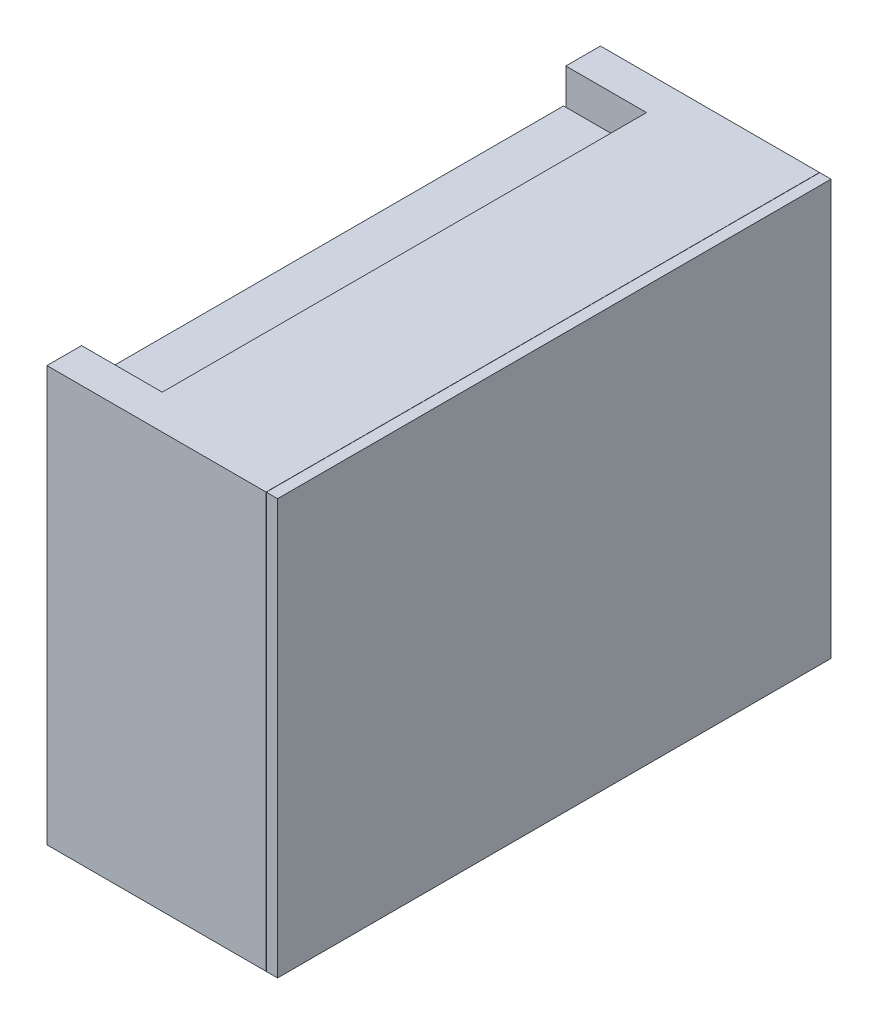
ISO-10303-21;
HEADER;
FILE_DESCRIPTION(('STEP AP214'),'2;1');
FILE_NAME('part.step','',(''),(''),'','','');
FILE_SCHEMA(('AUTOMOTIVE_DESIGN { 1 0 10303 214 1 1 1 1 }'));
ENDSEC;
DATA;
#1=APPLICATION_CONTEXT('core data for automotive mechanical design processes');
#2=APPLICATION_PROTOCOL_DEFINITION('international standard','automotive_design',2000,#1);
#3=PRODUCT_CONTEXT('',#1,'mechanical');
#4=PRODUCT('Part','Part','',(#3));
#5=PRODUCT_RELATED_PRODUCT_CATEGORY('part','',(#4));
#6=PRODUCT_DEFINITION_FORMATION('','',#4);
#7=PRODUCT_DEFINITION_CONTEXT('part definition',#1,'design');
#8=PRODUCT_DEFINITION('design','',#6,#7);
#9=PRODUCT_DEFINITION_SHAPE('','',#8);
#10=(LENGTH_UNIT() NAMED_UNIT(*) SI_UNIT(.MILLI.,.METRE.));
#11=(NAMED_UNIT(*) PLANE_ANGLE_UNIT() SI_UNIT($,.RADIAN.));
#12=(NAMED_UNIT(*) SI_UNIT($,.STERADIAN.) SOLID_ANGLE_UNIT());
#13=UNCERTAINTY_MEASURE_WITH_UNIT(LENGTH_MEASURE(1.E-05),#10,'distance_accuracy_value','');
#14=(GEOMETRIC_REPRESENTATION_CONTEXT(3) GLOBAL_UNCERTAINTY_ASSIGNED_CONTEXT((#13)) GLOBAL_UNIT_ASSIGNED_CONTEXT((#10,
#11,#12)) REPRESENTATION_CONTEXT('',''));
#15=CARTESIAN_POINT('',(0.,0.,0.));
#16=DIRECTION('',(0.,0.,1.));
#17=DIRECTION('',(1.,0.,0.));
#18=AXIS2_PLACEMENT_3D('',#15,#16,#17);
#19=CARTESIAN_POINT('',(-10.,-9.,12.));
#20=DIRECTION('',(1.,0.,0.));
#21=DIRECTION('',(0.,0.,-1.));
#22=AXIS2_PLACEMENT_3D('',#19,#20,#21);
#23=PLANE('',#22);
#24=DIRECTION('',(0.,0.,1.));
#25=VECTOR('',#24,1.);
#26=CARTESIAN_POINT('',(-10.,9.,12.));
#27=LINE('',#26,#25);
#28=CARTESIAN_POINT('',(-10.,9.,10.5));
#29=VERTEX_POINT('',#28);
#30=CARTESIAN_POINT('',(-10.,9.,12.));
#31=VERTEX_POINT('',#30);
#32=EDGE_CURVE('E314',#29,#31,#27,.T.);
#33=ORIENTED_EDGE('',*,*,#32,.F.);
#34=DIRECTION('',(0.,1.,0.));
#35=VECTOR('',#34,1.);
#36=CARTESIAN_POINT('',(-10.,9.,10.5));
#37=LINE('',#36,#35);
#38=CARTESIAN_POINT('',(-10.,-9.,10.5));
#39=VERTEX_POINT('',#38);
#40=EDGE_CURVE('E270',#39,#29,#37,.T.);
#41=ORIENTED_EDGE('',*,*,#40,.F.);
#42=DIRECTION('',(0.,0.,-1.));
#43=VECTOR('',#42,1.);
#44=CARTESIAN_POINT('',(-10.,-9.,12.));
#45=LINE('',#44,#43);
#46=CARTESIAN_POINT('',(-10.,-9.,12.));
#47=VERTEX_POINT('',#46);
#48=EDGE_CURVE('E308',#47,#39,#45,.T.);
#49=ORIENTED_EDGE('',*,*,#48,.F.);
#50=DIRECTION('',(0.,-1.,0.));
#51=VECTOR('',#50,1.);
#52=CARTESIAN_POINT('',(-10.,9.,12.));
#53=LINE('',#52,#51);
#54=EDGE_CURVE('E304',#31,#47,#53,.T.);
#55=ORIENTED_EDGE('',*,*,#54,.F.);
#56=EDGE_LOOP('',(#33,#41,#49,#55));
#57=FACE_BOUND('',#56,.T.);
#58=ADVANCED_FACE('F17',(#57),#23,.F.);
#59=CARTESIAN_POINT('',(-10.,-9.,-10.5));
#60=VERTEX_POINT('',#59);
#61=CARTESIAN_POINT('',(-10.,-9.,-12.));
#62=VERTEX_POINT('',#61);
#63=EDGE_CURVE('E307',#60,#62,#45,.T.);
#64=ORIENTED_EDGE('',*,*,#63,.F.);
#65=DIRECTION('',(0.,-1.,0.));
#66=VECTOR('',#65,1.);
#67=CARTESIAN_POINT('',(-10.,9.,-10.5));
#68=LINE('',#67,#66);
#69=CARTESIAN_POINT('',(-10.,9.,-10.5));
#70=VERTEX_POINT('',#69);
#71=EDGE_CURVE('E268',#70,#60,#68,.T.);
#72=ORIENTED_EDGE('',*,*,#71,.F.);
#73=CARTESIAN_POINT('',(-10.,9.,-12.));
#74=VERTEX_POINT('',#73);
#75=EDGE_CURVE('E315',#74,#70,#27,.T.);
#76=ORIENTED_EDGE('',*,*,#75,.F.);
#77=DIRECTION('',(0.,1.,0.));
#78=VECTOR('',#77,1.);
#79=CARTESIAN_POINT('',(-10.,9.,-12.));
#80=LINE('',#79,#78);
#81=EDGE_CURVE('E311',#62,#74,#80,.T.);
#82=ORIENTED_EDGE('',*,*,#81,.F.);
#83=EDGE_LOOP('',(#64,#72,#76,#82));
#84=FACE_BOUND('',#83,.T.);
#85=ADVANCED_FACE('F552',(#84),#23,.F.);
#86=CARTESIAN_POINT('',(-6.5,9.,-10.5));
#87=DIRECTION('',(0.,0.,-1.));
#88=DIRECTION('',(0.,1.,0.));
#89=AXIS2_PLACEMENT_3D('',#86,#87,#88);
#90=PLANE('',#89);
#91=ORIENTED_EDGE('',*,*,#71,.T.);
#92=DIRECTION('',(-1.,0.,0.));
#93=VECTOR('',#92,1.);
#94=CARTESIAN_POINT('',(-6.5,-9.,-10.5));
#95=LINE('',#94,#93);
#96=CARTESIAN_POINT('',(-6.5,-9.,-10.5));
#97=VERTEX_POINT('',#96);
#98=EDGE_CURVE('E282',#97,#60,#95,.T.);
#99=ORIENTED_EDGE('',*,*,#98,.F.);
#100=DIRECTION('',(0.,-1.,0.));
#101=VECTOR('',#100,1.);
#102=CARTESIAN_POINT('',(-6.5,9.,-10.5));
#103=LINE('',#102,#101);
#104=CARTESIAN_POINT('',(-6.5,9.,-10.5));
#105=VERTEX_POINT('',#104);
#106=EDGE_CURVE('E272',#105,#97,#103,.T.);
#107=ORIENTED_EDGE('',*,*,#106,.F.);
#108=DIRECTION('',(-1.,0.,0.));
#109=VECTOR('',#108,1.);
#110=CARTESIAN_POINT('',(-6.5,9.,-10.5));
#111=LINE('',#110,#109);
#112=EDGE_CURVE('E283',#105,#70,#111,.T.);
#113=ORIENTED_EDGE('',*,*,#112,.T.);
#114=EDGE_LOOP('',(#91,#99,#107,#113));
#115=FACE_BOUND('',#114,.T.);
#116=ADVANCED_FACE('F641',(#115),#90,.F.);
#117=CARTESIAN_POINT('',(-6.5,9.,10.5));
#118=DIRECTION('',(0.,0.,1.));
#119=DIRECTION('',(0.,-1.,0.));
#120=AXIS2_PLACEMENT_3D('',#117,#118,#119);
#121=PLANE('',#120);
#122=DIRECTION('',(-1.,0.,0.));
#123=VECTOR('',#122,1.);
#124=CARTESIAN_POINT('',(-6.5,9.,10.5));
#125=LINE('',#124,#123);
#126=CARTESIAN_POINT('',(-6.5,9.,10.5));
#127=VERTEX_POINT('',#126);
#128=EDGE_CURVE('E286',#127,#29,#125,.T.);
#129=ORIENTED_EDGE('',*,*,#128,.F.);
#130=DIRECTION('',(0.,1.,0.));
#131=VECTOR('',#130,1.);
#132=CARTESIAN_POINT('',(-6.5,9.,10.5));
#133=LINE('',#132,#131);
#134=CARTESIAN_POINT('',(-6.5,-9.,10.5));
#135=VERTEX_POINT('',#134);
#136=EDGE_CURVE('E277',#135,#127,#133,.T.);
#137=ORIENTED_EDGE('',*,*,#136,.F.);
#138=DIRECTION('',(-1.,0.,0.));
#139=VECTOR('',#138,1.);
#140=CARTESIAN_POINT('',(-6.5,-9.,10.5));
#141=LINE('',#140,#139);
#142=EDGE_CURVE('E289',#135,#39,#141,.T.);
#143=ORIENTED_EDGE('',*,*,#142,.T.);
#144=ORIENTED_EDGE('',*,*,#40,.T.);
#145=EDGE_LOOP('',(#129,#137,#143,#144));
#146=FACE_BOUND('',#145,.T.);
#147=ADVANCED_FACE('F408',(#146),#121,.F.);
#148=CARTESIAN_POINT('',(-6.5,-9.,-10.5));
#149=DIRECTION('',(-1.,0.,0.));
#150=DIRECTION('',(0.,0.,1.));
#151=AXIS2_PLACEMENT_3D('',#148,#149,#150);
#152=PLANE('',#151);
#153=DIRECTION('',(0.,1.,0.));
#154=VECTOR('',#153,1.);
#155=CARTESIAN_POINT('',(-6.5,7.55,10.4));
#156=LINE('',#155,#154);
#157=CARTESIAN_POINT('',(-6.5,-7.55,10.4));
#158=VERTEX_POINT('',#157);
#159=CARTESIAN_POINT('',(-6.5,7.55,10.4));
#160=VERTEX_POINT('',#159);
#161=EDGE_CURVE('E184',#158,#160,#156,.T.);
#162=ORIENTED_EDGE('',*,*,#161,.F.);
#163=DIRECTION('',(0.,0.,-1.));
#164=VECTOR('',#163,1.);
#165=CARTESIAN_POINT('',(-6.5,-7.55,-10.5));
#166=LINE('',#165,#164);
#167=CARTESIAN_POINT('',(-6.5,-7.55,-10.4));
#168=VERTEX_POINT('',#167);
#169=EDGE_CURVE('E10',#158,#168,#166,.T.);
#170=ORIENTED_EDGE('',*,*,#169,.T.);
#171=DIRECTION('',(0.,-1.,0.));
#172=VECTOR('',#171,1.);
#173=CARTESIAN_POINT('',(-6.5,7.55,-10.4));
#174=LINE('',#173,#172);
#175=CARTESIAN_POINT('',(-6.5,7.55,-10.4));
#176=VERTEX_POINT('',#175);
#177=EDGE_CURVE('E346',#176,#168,#174,.T.);
#178=ORIENTED_EDGE('',*,*,#177,.F.);
#179=DIRECTION('',(0.,0.,1.));
#180=VECTOR('',#179,1.);
#181=CARTESIAN_POINT('',(-6.5,7.55,-10.5));
#182=LINE('',#181,#180);
#183=EDGE_CURVE('E26',#176,#160,#182,.T.);
#184=ORIENTED_EDGE('',*,*,#183,.T.);
#185=EDGE_LOOP('',(#162,#170,#178,#184));
#186=FACE_BOUND('',#185,.T.);
#187=ORIENTED_EDGE('',*,*,#106,.T.);
#188=DIRECTION('',(0.,0.,1.));
#189=VECTOR('',#188,1.);
#190=CARTESIAN_POINT('',(-6.5,-9.,-10.5));
#191=LINE('',#190,#189);
#192=EDGE_CURVE('E274',#97,#135,#191,.T.);
#193=ORIENTED_EDGE('',*,*,#192,.T.);
#194=ORIENTED_EDGE('',*,*,#136,.T.);
#195=DIRECTION('',(0.,0.,-1.));
#196=VECTOR('',#195,1.);
#197=CARTESIAN_POINT('',(-6.5,9.,-10.5));
#198=LINE('',#197,#196);
#199=EDGE_CURVE('E279',#127,#105,#198,.T.);
#200=ORIENTED_EDGE('',*,*,#199,.T.);
#201=EDGE_LOOP('',(#187,#193,#194,#200));
#202=FACE_BOUND('',#201,.T.);
#203=ADVANCED_FACE('F343',(#186,#202),#152,.T.);
#204=CARTESIAN_POINT('',(-10.,9.,12.));
#205=DIRECTION('',(0.,0.,1.));
#206=DIRECTION('',(1.,0.,0.));
#207=AXIS2_PLACEMENT_3D('',#204,#205,#206);
#208=PLANE('',#207);
#209=DIRECTION('',(1.,0.,0.));
#210=VECTOR('',#209,1.);
#211=CARTESIAN_POINT('',(-10.,9.,12.));
#212=LINE('',#211,#210);
#213=CARTESIAN_POINT('',(-0.49,9.,12.));
#214=VERTEX_POINT('',#213);
#215=CARTESIAN_POINT('',(0.,9.,12.));
#216=VERTEX_POINT('',#215);
#217=EDGE_CURVE('E323',#214,#216,#212,.T.);
#218=ORIENTED_EDGE('',*,*,#217,.F.);
#219=DIRECTION('',(0.,-1.,0.));
#220=VECTOR('',#219,1.);
#221=CARTESIAN_POINT('',(-0.49,9.,12.));
#222=LINE('',#221,#220);
#223=CARTESIAN_POINT('',(-0.49,-9.,12.));
#224=VERTEX_POINT('',#223);
#225=EDGE_CURVE('E256',#214,#224,#222,.T.);
#226=ORIENTED_EDGE('',*,*,#225,.T.);
#227=DIRECTION('',(1.,0.,0.));
#228=VECTOR('',#227,1.);
#229=CARTESIAN_POINT('',(-10.,-9.,12.));
#230=LINE('',#229,#228);
#231=CARTESIAN_POINT('',(0.,-9.,12.));
#232=VERTEX_POINT('',#231);
#233=EDGE_CURVE('E318',#224,#232,#230,.T.);
#234=ORIENTED_EDGE('',*,*,#233,.T.);
#235=DIRECTION('',(0.,-1.,0.));
#236=VECTOR('',#235,1.);
#237=CARTESIAN_POINT('',(0.,9.,12.));
#238=LINE('',#237,#236);
#239=EDGE_CURVE('E285',#216,#232,#238,.T.);
#240=ORIENTED_EDGE('',*,*,#239,.F.);
#241=EDGE_LOOP('',(#218,#226,#234,#240));
#242=FACE_BOUND('',#241,.T.);
#243=ADVANCED_FACE('F407',(#242),#208,.T.);
#244=CARTESIAN_POINT('',(-10.,9.,12.));
#245=DIRECTION('',(0.,1.,0.));
#246=DIRECTION('',(0.,0.,1.));
#247=AXIS2_PLACEMENT_3D('',#244,#245,#246);
#248=PLANE('',#247);
#249=DIRECTION('',(1.,0.,0.));
#250=VECTOR('',#249,1.);
#251=CARTESIAN_POINT('',(-10.,9.,-12.));
#252=LINE('',#251,#250);
#253=CARTESIAN_POINT('',(-0.49,9.,-12.));
#254=VERTEX_POINT('',#253);
#255=CARTESIAN_POINT('',(0.,9.,-12.));
#256=VERTEX_POINT('',#255);
#257=EDGE_CURVE('E327',#254,#256,#252,.T.);
#258=ORIENTED_EDGE('',*,*,#257,.F.);
#259=DIRECTION('',(0.,0.,1.));
#260=VECTOR('',#259,1.);
#261=CARTESIAN_POINT('',(-0.49,9.,-12.));
#262=LINE('',#261,#260);
#263=EDGE_CURVE('E253',#254,#214,#262,.T.);
#264=ORIENTED_EDGE('',*,*,#263,.T.);
#265=ORIENTED_EDGE('',*,*,#217,.T.);
#266=DIRECTION('',(0.,0.,1.));
#267=VECTOR('',#266,1.);
#268=CARTESIAN_POINT('',(0.,9.,12.));
#269=LINE('',#268,#267);
#270=EDGE_CURVE('E301',#256,#216,#269,.T.);
#271=ORIENTED_EDGE('',*,*,#270,.F.);
#272=EDGE_LOOP('',(#258,#264,#265,#271));
#273=FACE_BOUND('',#272,.T.);
#274=ADVANCED_FACE('F585',(#273),#248,.T.);
#275=CARTESIAN_POINT('',(-10.,9.,-12.));
#276=DIRECTION('',(0.,0.,-1.));
#277=DIRECTION('',(0.,1.,0.));
#278=AXIS2_PLACEMENT_3D('',#275,#276,#277);
#279=PLANE('',#278);
#280=DIRECTION('',(1.,0.,0.));
#281=VECTOR('',#280,1.);
#282=CARTESIAN_POINT('',(-10.,-9.,-12.));
#283=LINE('',#282,#281);
#284=CARTESIAN_POINT('',(-0.49,-9.,-12.));
#285=VERTEX_POINT('',#284);
#286=CARTESIAN_POINT('',(0.,-9.,-12.));
#287=VERTEX_POINT('',#286);
#288=EDGE_CURVE('E331',#285,#287,#283,.T.);
#289=ORIENTED_EDGE('',*,*,#288,.F.);
#290=DIRECTION('',(0.,1.,0.));
#291=VECTOR('',#290,1.);
#292=CARTESIAN_POINT('',(-0.49,-9.,-12.));
#293=LINE('',#292,#291);
#294=EDGE_CURVE('E262',#285,#254,#293,.T.);
#295=ORIENTED_EDGE('',*,*,#294,.T.);
#296=ORIENTED_EDGE('',*,*,#257,.T.);
#297=DIRECTION('',(0.,1.,0.));
#298=VECTOR('',#297,1.);
#299=CARTESIAN_POINT('',(0.,9.,-12.));
#300=LINE('',#299,#298);
#301=EDGE_CURVE('E298',#287,#256,#300,.T.);
#302=ORIENTED_EDGE('',*,*,#301,.F.);
#303=EDGE_LOOP('',(#289,#295,#296,#302));
#304=FACE_BOUND('',#303,.T.);
#305=ADVANCED_FACE('F576',(#304),#279,.T.);
#306=CARTESIAN_POINT('',(-10.,-9.,12.));
#307=DIRECTION('',(0.,-1.,0.));
#308=DIRECTION('',(0.,0.,-1.));
#309=AXIS2_PLACEMENT_3D('',#306,#307,#308);
#310=PLANE('',#309);
#311=ORIENTED_EDGE('',*,*,#233,.F.);
#312=DIRECTION('',(0.,0.,-1.));
#313=VECTOR('',#312,1.);
#314=CARTESIAN_POINT('',(-0.49,-9.,12.));
#315=LINE('',#314,#313);
#316=EDGE_CURVE('E259',#224,#285,#315,.T.);
#317=ORIENTED_EDGE('',*,*,#316,.T.);
#318=ORIENTED_EDGE('',*,*,#288,.T.);
#319=DIRECTION('',(0.,0.,-1.));
#320=VECTOR('',#319,1.);
#321=CARTESIAN_POINT('',(0.,-9.,12.));
#322=LINE('',#321,#320);
#323=EDGE_CURVE('E295',#232,#287,#322,.T.);
#324=ORIENTED_EDGE('',*,*,#323,.F.);
#325=EDGE_LOOP('',(#311,#317,#318,#324));
#326=FACE_BOUND('',#325,.T.);
#327=ADVANCED_FACE('F565',(#326),#310,.T.);
#328=CARTESIAN_POINT('',(0.,-9.,12.));
#329=DIRECTION('',(1.,0.,0.));
#330=DIRECTION('',(0.,0.,-1.));
#331=AXIS2_PLACEMENT_3D('',#328,#329,#330);
#332=PLANE('',#331);
#333=ORIENTED_EDGE('',*,*,#239,.T.);
#334=ORIENTED_EDGE('',*,*,#323,.T.);
#335=ORIENTED_EDGE('',*,*,#301,.T.);
#336=ORIENTED_EDGE('',*,*,#270,.T.);
#337=EDGE_LOOP('',(#333,#334,#335,#336));
#338=FACE_BOUND('',#337,.T.);
#339=ADVANCED_FACE('F592',(#338),#332,.T.);
#340=DIRECTION('',(0.,-1.,0.));
#341=VECTOR('',#340,1.);
#342=CARTESIAN_POINT('',(-0.5,9.,12.));
#343=LINE('',#342,#341);
#344=CARTESIAN_POINT('',(-0.5,9.,12.));
#345=VERTEX_POINT('',#344);
#346=CARTESIAN_POINT('',(-0.5,-9.,12.));
#347=VERTEX_POINT('',#346);
#348=EDGE_CURVE('E247',#345,#347,#343,.T.);
#349=ORIENTED_EDGE('',*,*,#348,.F.);
#350=EDGE_CURVE('E319',#31,#345,#212,.T.);
#351=ORIENTED_EDGE('',*,*,#350,.F.);
#352=ORIENTED_EDGE('',*,*,#54,.T.);
#353=EDGE_CURVE('E332',#47,#347,#230,.T.);
#354=ORIENTED_EDGE('',*,*,#353,.T.);
#355=EDGE_LOOP('',(#349,#351,#352,#354));
#356=FACE_BOUND('',#355,.T.);
#357=ADVANCED_FACE('F19',(#356),#208,.T.);
#358=DIRECTION('',(0.,0.,1.));
#359=VECTOR('',#358,1.);
#360=CARTESIAN_POINT('',(-0.5,9.,-12.));
#361=LINE('',#360,#359);
#362=CARTESIAN_POINT('',(-0.5,9.,-12.));
#363=VERTEX_POINT('',#362);
#364=EDGE_CURVE('E245',#363,#345,#361,.T.);
#365=ORIENTED_EDGE('',*,*,#364,.F.);
#366=EDGE_CURVE('E324',#74,#363,#252,.T.);
#367=ORIENTED_EDGE('',*,*,#366,.F.);
#368=ORIENTED_EDGE('',*,*,#75,.T.);
#369=ORIENTED_EDGE('',*,*,#112,.F.);
#370=ORIENTED_EDGE('',*,*,#199,.F.);
#371=ORIENTED_EDGE('',*,*,#128,.T.);
#372=ORIENTED_EDGE('',*,*,#32,.T.);
#373=ORIENTED_EDGE('',*,*,#350,.T.);
#374=EDGE_LOOP('',(#365,#367,#368,#369,#370,#371,#372,#373));
#375=FACE_BOUND('',#374,.T.);
#376=ADVANCED_FACE('F573',(#375),#248,.T.);
#377=DIRECTION('',(0.,1.,0.));
#378=VECTOR('',#377,1.);
#379=CARTESIAN_POINT('',(-0.5,-9.,-12.));
#380=LINE('',#379,#378);
#381=CARTESIAN_POINT('',(-0.5,-9.,-12.));
#382=VERTEX_POINT('',#381);
#383=EDGE_CURVE('E251',#382,#363,#380,.T.);
#384=ORIENTED_EDGE('',*,*,#383,.F.);
#385=EDGE_CURVE('E328',#62,#382,#283,.T.);
#386=ORIENTED_EDGE('',*,*,#385,.F.);
#387=ORIENTED_EDGE('',*,*,#81,.T.);
#388=ORIENTED_EDGE('',*,*,#366,.T.);
#389=EDGE_LOOP('',(#384,#386,#387,#388));
#390=FACE_BOUND('',#389,.T.);
#391=ADVANCED_FACE('F563',(#390),#279,.T.);
#392=DIRECTION('',(0.,0.,-1.));
#393=VECTOR('',#392,1.);
#394=CARTESIAN_POINT('',(-0.5,-9.,12.));
#395=LINE('',#394,#393);
#396=EDGE_CURVE('E249',#347,#382,#395,.T.);
#397=ORIENTED_EDGE('',*,*,#396,.F.);
#398=ORIENTED_EDGE('',*,*,#353,.F.);
#399=ORIENTED_EDGE('',*,*,#48,.T.);
#400=ORIENTED_EDGE('',*,*,#142,.F.);
#401=ORIENTED_EDGE('',*,*,#192,.F.);
#402=ORIENTED_EDGE('',*,*,#98,.T.);
#403=ORIENTED_EDGE('',*,*,#63,.T.);
#404=ORIENTED_EDGE('',*,*,#385,.T.);
#405=EDGE_LOOP('',(#397,#398,#399,#400,#401,#402,#403,#404));
#406=FACE_BOUND('',#405,.T.);
#407=ADVANCED_FACE('F550',(#406),#310,.T.);
#408=DIRECTION('',(0.,0.,-1.));
#409=VECTOR('',#408,1.);
#410=CARTESIAN_POINT('',(-10.,-7.55,10.5));
#411=LINE('',#410,#409);
#412=CARTESIAN_POINT('',(-10.,-7.55,10.4));
#413=VERTEX_POINT('',#412);
#414=CARTESIAN_POINT('',(-10.,-7.55,-10.4));
#415=VERTEX_POINT('',#414);
#416=EDGE_CURVE('E197',#413,#415,#411,.T.);
#417=ORIENTED_EDGE('',*,*,#416,.F.);
#418=DIRECTION('',(0.,-1.,0.));
#419=VECTOR('',#418,1.);
#420=CARTESIAN_POINT('',(-10.,7.55,10.4));
#421=LINE('',#420,#419);
#422=CARTESIAN_POINT('',(-10.,7.55,10.4));
#423=VERTEX_POINT('',#422);
#424=EDGE_CURVE('E181',#423,#413,#421,.T.);
#425=ORIENTED_EDGE('',*,*,#424,.F.);
#426=DIRECTION('',(0.,0.,1.));
#427=VECTOR('',#426,1.);
#428=CARTESIAN_POINT('',(-10.,7.55,10.5));
#429=LINE('',#428,#427);
#430=CARTESIAN_POINT('',(-10.,7.55,-10.4));
#431=VERTEX_POINT('',#430);
#432=EDGE_CURVE('E196',#431,#423,#429,.T.);
#433=ORIENTED_EDGE('',*,*,#432,.F.);
#434=DIRECTION('',(0.,1.,0.));
#435=VECTOR('',#434,1.);
#436=CARTESIAN_POINT('',(-10.,7.55,-10.4));
#437=LINE('',#436,#435);
#438=EDGE_CURVE('E358',#415,#431,#437,.T.);
#439=ORIENTED_EDGE('',*,*,#438,.F.);
#440=EDGE_LOOP('',(#417,#425,#433,#439));
#441=FACE_BOUND('',#440,.T.);
#442=ADVANCED_FACE('F194',(#441),#23,.F.);
#443=CARTESIAN_POINT('',(-0.49,9.,-12.));
#444=DIRECTION('',(-1.,0.,0.));
#445=DIRECTION('',(0.,0.,1.));
#446=AXIS2_PLACEMENT_3D('',#443,#444,#445);
#447=PLANE('',#446);
#448=ORIENTED_EDGE('',*,*,#263,.F.);
#449=ORIENTED_EDGE('',*,*,#294,.F.);
#450=ORIENTED_EDGE('',*,*,#316,.F.);
#451=ORIENTED_EDGE('',*,*,#225,.F.);
#452=EDGE_LOOP('',(#448,#449,#450,#451));
#453=FACE_BOUND('',#452,.T.);
#454=DIRECTION('',(0.,0.,1.));
#455=VECTOR('',#454,1.);
#456=CARTESIAN_POINT('',(-0.49,8.9,-12.));
#457=LINE('',#456,#455);
#458=CARTESIAN_POINT('',(-0.49,8.9,-11.9));
#459=VERTEX_POINT('',#458);
#460=CARTESIAN_POINT('',(-0.49,8.9,11.9));
#461=VERTEX_POINT('',#460);
#462=EDGE_CURVE('E226',#459,#461,#457,.T.);
#463=ORIENTED_EDGE('',*,*,#462,.T.);
#464=DIRECTION('',(0.,-1.,0.));
#465=VECTOR('',#464,1.);
#466=CARTESIAN_POINT('',(-0.49,9.,11.9));
#467=LINE('',#466,#465);
#468=CARTESIAN_POINT('',(-0.49,-8.9,11.9));
#469=VERTEX_POINT('',#468);
#470=EDGE_CURVE('E228',#461,#469,#467,.T.);
#471=ORIENTED_EDGE('',*,*,#470,.T.);
#472=DIRECTION('',(0.,0.,-1.));
#473=VECTOR('',#472,1.);
#474=CARTESIAN_POINT('',(-0.49,-8.9,-12.));
#475=LINE('',#474,#473);
#476=CARTESIAN_POINT('',(-0.49,-8.9,-11.9));
#477=VERTEX_POINT('',#476);
#478=EDGE_CURVE('E230',#469,#477,#475,.T.);
#479=ORIENTED_EDGE('',*,*,#478,.T.);
#480=DIRECTION('',(0.,1.,0.));
#481=VECTOR('',#480,1.);
#482=CARTESIAN_POINT('',(-0.49,9.,-11.9));
#483=LINE('',#482,#481);
#484=EDGE_CURVE('E233',#477,#459,#483,.T.);
#485=ORIENTED_EDGE('',*,*,#484,.T.);
#486=EDGE_LOOP('',(#463,#471,#479,#485));
#487=FACE_BOUND('',#486,.T.);
#488=ADVANCED_FACE('F456',(#453,#487),#447,.T.);
#489=CARTESIAN_POINT('',(-0.5,9.,-12.));
#490=DIRECTION('',(-1.,0.,0.));
#491=DIRECTION('',(0.,0.,1.));
#492=AXIS2_PLACEMENT_3D('',#489,#490,#491);
#493=PLANE('',#492);
#494=ORIENTED_EDGE('',*,*,#364,.T.);
#495=ORIENTED_EDGE('',*,*,#348,.T.);
#496=ORIENTED_EDGE('',*,*,#396,.T.);
#497=ORIENTED_EDGE('',*,*,#383,.T.);
#498=EDGE_LOOP('',(#494,#495,#496,#497));
#499=FACE_BOUND('',#498,.T.);
#500=DIRECTION('',(0.,1.,0.));
#501=VECTOR('',#500,1.);
#502=CARTESIAN_POINT('',(-0.5,9.,-11.9));
#503=LINE('',#502,#501);
#504=CARTESIAN_POINT('',(-0.5,-8.9,-11.9));
#505=VERTEX_POINT('',#504);
#506=CARTESIAN_POINT('',(-0.5,8.9,-11.9));
#507=VERTEX_POINT('',#506);
#508=EDGE_CURVE('E223',#505,#507,#503,.T.);
#509=ORIENTED_EDGE('',*,*,#508,.F.);
#510=DIRECTION('',(0.,0.,-1.));
#511=VECTOR('',#510,1.);
#512=CARTESIAN_POINT('',(-0.5,-8.9,-12.));
#513=LINE('',#512,#511);
#514=CARTESIAN_POINT('',(-0.5,-8.9,11.9));
#515=VERTEX_POINT('',#514);
#516=EDGE_CURVE('E220',#515,#505,#513,.T.);
#517=ORIENTED_EDGE('',*,*,#516,.F.);
#518=DIRECTION('',(0.,-1.,0.));
#519=VECTOR('',#518,1.);
#520=CARTESIAN_POINT('',(-0.5,9.,11.9));
#521=LINE('',#520,#519);
#522=CARTESIAN_POINT('',(-0.5,8.9,11.9));
#523=VERTEX_POINT('',#522);
#524=EDGE_CURVE('E217',#523,#515,#521,.T.);
#525=ORIENTED_EDGE('',*,*,#524,.F.);
#526=DIRECTION('',(0.,0.,1.));
#527=VECTOR('',#526,1.);
#528=CARTESIAN_POINT('',(-0.5,8.9,-12.));
#529=LINE('',#528,#527);
#530=EDGE_CURVE('E214',#507,#523,#529,.T.);
#531=ORIENTED_EDGE('',*,*,#530,.F.);
#532=EDGE_LOOP('',(#509,#517,#525,#531));
#533=FACE_BOUND('',#532,.T.);
#534=ADVANCED_FACE('F452',(#499,#533),#493,.F.);
#535=CARTESIAN_POINT('',(-0.49,8.9,-12.));
#536=DIRECTION('',(0.,-1.,0.));
#537=DIRECTION('',(0.,0.,-1.));
#538=AXIS2_PLACEMENT_3D('',#535,#536,#537);
#539=PLANE('',#538);
#540=ORIENTED_EDGE('',*,*,#530,.T.);
#541=DIRECTION('',(-1.,0.,0.));
#542=VECTOR('',#541,1.);
#543=CARTESIAN_POINT('',(-0.49,8.9,11.9));
#544=LINE('',#543,#542);
#545=EDGE_CURVE('E242',#461,#523,#544,.T.);
#546=ORIENTED_EDGE('',*,*,#545,.F.);
#547=ORIENTED_EDGE('',*,*,#462,.F.);
#548=DIRECTION('',(-1.,0.,0.));
#549=VECTOR('',#548,1.);
#550=CARTESIAN_POINT('',(-0.49,8.9,-11.9));
#551=LINE('',#550,#549);
#552=EDGE_CURVE('E235',#459,#507,#551,.T.);
#553=ORIENTED_EDGE('',*,*,#552,.T.);
#554=EDGE_LOOP('',(#540,#546,#547,#553));
#555=FACE_BOUND('',#554,.T.);
#556=ADVANCED_FACE('F448',(#555),#539,.F.);
#557=CARTESIAN_POINT('',(-0.49,9.,11.9));
#558=DIRECTION('',(0.,0.,-1.));
#559=DIRECTION('',(-1.,0.,0.));
#560=AXIS2_PLACEMENT_3D('',#557,#558,#559);
#561=PLANE('',#560);
#562=ORIENTED_EDGE('',*,*,#524,.T.);
#563=DIRECTION('',(-1.,0.,0.));
#564=VECTOR('',#563,1.);
#565=CARTESIAN_POINT('',(-0.49,-8.9,11.9));
#566=LINE('',#565,#564);
#567=EDGE_CURVE('E240',#469,#515,#566,.T.);
#568=ORIENTED_EDGE('',*,*,#567,.F.);
#569=ORIENTED_EDGE('',*,*,#470,.F.);
#570=ORIENTED_EDGE('',*,*,#545,.T.);
#571=EDGE_LOOP('',(#562,#568,#569,#570));
#572=FACE_BOUND('',#571,.T.);
#573=ADVANCED_FACE('F444',(#572),#561,.F.);
#574=CARTESIAN_POINT('',(-0.49,-8.9,-12.));
#575=DIRECTION('',(0.,1.,0.));
#576=DIRECTION('',(0.,0.,1.));
#577=AXIS2_PLACEMENT_3D('',#574,#575,#576);
#578=PLANE('',#577);
#579=ORIENTED_EDGE('',*,*,#516,.T.);
#580=DIRECTION('',(-1.,0.,0.));
#581=VECTOR('',#580,1.);
#582=CARTESIAN_POINT('',(-0.49,-8.9,-11.9));
#583=LINE('',#582,#581);
#584=EDGE_CURVE('E238',#477,#505,#583,.T.);
#585=ORIENTED_EDGE('',*,*,#584,.F.);
#586=ORIENTED_EDGE('',*,*,#478,.F.);
#587=ORIENTED_EDGE('',*,*,#567,.T.);
#588=EDGE_LOOP('',(#579,#585,#586,#587));
#589=FACE_BOUND('',#588,.T.);
#590=ADVANCED_FACE('F440',(#589),#578,.F.);
#591=CARTESIAN_POINT('',(-0.49,9.,-11.9));
#592=DIRECTION('',(0.,0.,1.));
#593=DIRECTION('',(0.,-1.,0.));
#594=AXIS2_PLACEMENT_3D('',#591,#592,#593);
#595=PLANE('',#594);
#596=ORIENTED_EDGE('',*,*,#508,.T.);
#597=ORIENTED_EDGE('',*,*,#552,.F.);
#598=ORIENTED_EDGE('',*,*,#484,.F.);
#599=ORIENTED_EDGE('',*,*,#584,.T.);
#600=EDGE_LOOP('',(#596,#597,#598,#599));
#601=FACE_BOUND('',#600,.T.);
#602=ADVANCED_FACE('F426',(#601),#595,.F.);
#603=CARTESIAN_POINT('',(-5.,-7.55,10.5));
#604=DIRECTION('',(0.,1.,0.));
#605=DIRECTION('',(0.,0.,1.));
#606=AXIS2_PLACEMENT_3D('',#603,#604,#605);
#607=PLANE('',#606);
#608=ORIENTED_EDGE('',*,*,#169,.F.);
#609=DIRECTION('',(-1.,0.,0.));
#610=VECTOR('',#609,1.);
#611=CARTESIAN_POINT('',(8.60033112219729,-7.55,10.4));
#612=LINE('',#611,#610);
#613=EDGE_CURVE('E189',#158,#413,#612,.T.);
#614=ORIENTED_EDGE('',*,*,#613,.T.);
#615=ORIENTED_EDGE('',*,*,#416,.T.);
#616=DIRECTION('',(-1.,0.,0.));
#617=VECTOR('',#616,1.);
#618=CARTESIAN_POINT('',(8.60033112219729,-7.55,-10.4));
#619=LINE('',#618,#617);
#620=EDGE_CURVE('E354',#168,#415,#619,.T.);
#621=ORIENTED_EDGE('',*,*,#620,.F.);
#622=EDGE_LOOP('',(#608,#614,#615,#621));
#623=FACE_BOUND('',#622,.T.);
#624=ADVANCED_FACE('F423',(#623),#607,.F.);
#625=CARTESIAN_POINT('',(-5.,7.55,10.5));
#626=DIRECTION('',(0.,-1.,0.));
#627=DIRECTION('',(0.,0.,-1.));
#628=AXIS2_PLACEMENT_3D('',#625,#626,#627);
#629=PLANE('',#628);
#630=ORIENTED_EDGE('',*,*,#432,.T.);
#631=DIRECTION('',(-1.,0.,0.));
#632=VECTOR('',#631,1.);
#633=CARTESIAN_POINT('',(8.60033112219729,7.55,10.4));
#634=LINE('',#633,#632);
#635=EDGE_CURVE('E178',#160,#423,#634,.T.);
#636=ORIENTED_EDGE('',*,*,#635,.F.);
#637=ORIENTED_EDGE('',*,*,#183,.F.);
#638=DIRECTION('',(-1.,0.,0.));
#639=VECTOR('',#638,1.);
#640=CARTESIAN_POINT('',(8.60033112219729,7.55,-10.4));
#641=LINE('',#640,#639);
#642=EDGE_CURVE('E33',#176,#431,#641,.T.);
#643=ORIENTED_EDGE('',*,*,#642,.T.);
#644=EDGE_LOOP('',(#630,#636,#637,#643));
#645=FACE_BOUND('',#644,.T.);
#646=ADVANCED_FACE('F199',(#645),#629,.F.);
#647=CARTESIAN_POINT('',(8.60033112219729,7.55,-10.4));
#648=DIRECTION('',(0.,0.,1.));
#649=DIRECTION('',(0.,-1.,0.));
#650=AXIS2_PLACEMENT_3D('',#647,#648,#649);
#651=PLANE('',#650);
#652=ORIENTED_EDGE('',*,*,#177,.T.);
#653=ORIENTED_EDGE('',*,*,#620,.T.);
#654=ORIENTED_EDGE('',*,*,#438,.T.);
#655=ORIENTED_EDGE('',*,*,#642,.F.);
#656=EDGE_LOOP('',(#652,#653,#654,#655));
#657=FACE_BOUND('',#656,.T.);
#658=ADVANCED_FACE('F422',(#657),#651,.F.);
#659=CARTESIAN_POINT('',(8.60033112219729,7.55,10.4));
#660=DIRECTION('',(0.,0.,-1.));
#661=DIRECTION('',(0.,1.,0.));
#662=AXIS2_PLACEMENT_3D('',#659,#660,#661);
#663=PLANE('',#662);
#664=ORIENTED_EDGE('',*,*,#161,.T.);
#665=ORIENTED_EDGE('',*,*,#635,.T.);
#666=ORIENTED_EDGE('',*,*,#424,.T.);
#667=ORIENTED_EDGE('',*,*,#613,.F.);
#668=EDGE_LOOP('',(#664,#665,#666,#667));
#669=FACE_BOUND('',#668,.T.);
#670=ADVANCED_FACE('F180',(#669),#663,.F.);
#671=CLOSED_SHELL('',(#58,#85,#116,#147,#203,#243,#274,#305,#327,#339,#357,#376,#391,#407,#442,
#488,#534,#556,#573,#590,#602,#624,#646,#658,#670));
#672=CARTESIAN_POINT('',(-9.5,-7.55,10.5));
#673=DIRECTION('',(1.,0.,0.));
#674=DIRECTION('',(0.,0.,-1.));
#675=AXIS2_PLACEMENT_3D('',#672,#673,#674);
#676=PLANE('',#675);
#677=DIRECTION('',(0.,-1.,0.));
#678=VECTOR('',#677,1.);
#679=CARTESIAN_POINT('',(-9.5,7.55,10.));
#680=LINE('',#679,#678);
#681=CARTESIAN_POINT('',(-9.5,7.05,10.));
#682=VERTEX_POINT('',#681);
#683=CARTESIAN_POINT('',(-9.5,-7.05,10.));
#684=VERTEX_POINT('',#683);
#685=EDGE_CURVE('E349',#682,#684,#680,.T.);
#686=ORIENTED_EDGE('',*,*,#685,.T.);
#687=DIRECTION('',(0.,0.,-1.));
#688=VECTOR('',#687,1.);
#689=CARTESIAN_POINT('',(-9.5,-7.05,10.5));
#690=LINE('',#689,#688);
#691=CARTESIAN_POINT('',(-9.5,-7.05,-10.));
#692=VERTEX_POINT('',#691);
#693=EDGE_CURVE('E352',#684,#692,#690,.T.);
#694=ORIENTED_EDGE('',*,*,#693,.T.);
#695=DIRECTION('',(0.,1.,0.));
#696=VECTOR('',#695,1.);
#697=CARTESIAN_POINT('',(-9.5,7.55,-10.));
#698=LINE('',#697,#696);
#699=CARTESIAN_POINT('',(-9.5,7.05,-10.));
#700=VERTEX_POINT('',#699);
#701=EDGE_CURVE('E369',#692,#700,#698,.T.);
#702=ORIENTED_EDGE('',*,*,#701,.T.);
#703=DIRECTION('',(0.,0.,1.));
#704=VECTOR('',#703,1.);
#705=CARTESIAN_POINT('',(-9.5,7.05,10.5));
#706=LINE('',#705,#704);
#707=EDGE_CURVE('E366',#700,#682,#706,.T.);
#708=ORIENTED_EDGE('',*,*,#707,.T.);
#709=EDGE_LOOP('',(#686,#694,#702,#708));
#710=FACE_BOUND('',#709,.T.);
#711=ADVANCED_FACE('F377',(#710),#676,.T.);
#712=CARTESIAN_POINT('',(-5.,7.05,10.5));
#713=DIRECTION('',(0.,-1.,0.));
#714=DIRECTION('',(0.,0.,-1.));
#715=AXIS2_PLACEMENT_3D('',#712,#713,#714);
#716=PLANE('',#715);
#717=DIRECTION('',(-1.,0.,0.));
#718=VECTOR('',#717,1.);
#719=CARTESIAN_POINT('',(-5.,7.05,-10.));
#720=LINE('',#719,#718);
#721=CARTESIAN_POINT('',(-6.5,7.05,-10.));
#722=VERTEX_POINT('',#721);
#723=EDGE_CURVE('E365',#722,#700,#720,.T.);
#724=ORIENTED_EDGE('',*,*,#723,.F.);
#725=DIRECTION('',(0.,0.,1.));
#726=VECTOR('',#725,1.);
#727=CARTESIAN_POINT('',(-6.5,7.05,-10.5));
#728=LINE('',#727,#726);
#729=CARTESIAN_POINT('',(-6.5,7.05,10.));
#730=VERTEX_POINT('',#729);
#731=EDGE_CURVE('E322',#722,#730,#728,.T.);
#732=ORIENTED_EDGE('',*,*,#731,.T.);
#733=DIRECTION('',(-1.,0.,0.));
#734=VECTOR('',#733,1.);
#735=CARTESIAN_POINT('',(-5.,7.05,10.));
#736=LINE('',#735,#734);
#737=EDGE_CURVE('E363',#730,#682,#736,.T.);
#738=ORIENTED_EDGE('',*,*,#737,.T.);
#739=ORIENTED_EDGE('',*,*,#707,.F.);
#740=EDGE_LOOP('',(#724,#732,#738,#739));
#741=FACE_BOUND('',#740,.T.);
#742=ADVANCED_FACE('F391',(#741),#716,.T.);
#743=CARTESIAN_POINT('',(-5.,7.55,-10.));
#744=DIRECTION('',(0.,0.,1.));
#745=DIRECTION('',(1.,0.,0.));
#746=AXIS2_PLACEMENT_3D('',#743,#744,#745);
#747=PLANE('',#746);
#748=DIRECTION('',(-1.,0.,0.));
#749=VECTOR('',#748,1.);
#750=CARTESIAN_POINT('',(-5.,-7.05,-10.));
#751=LINE('',#750,#749);
#752=CARTESIAN_POINT('',(-6.5,-7.05,-10.));
#753=VERTEX_POINT('',#752);
#754=EDGE_CURVE('E362',#753,#692,#751,.T.);
#755=ORIENTED_EDGE('',*,*,#754,.F.);
#756=DIRECTION('',(0.,1.,0.));
#757=VECTOR('',#756,1.);
#758=CARTESIAN_POINT('',(-6.5,-9.,-10.));
#759=LINE('',#758,#757);
#760=EDGE_CURVE('E337',#753,#722,#759,.T.);
#761=ORIENTED_EDGE('',*,*,#760,.T.);
#762=ORIENTED_EDGE('',*,*,#723,.T.);
#763=ORIENTED_EDGE('',*,*,#701,.F.);
#764=EDGE_LOOP('',(#755,#761,#762,#763));
#765=FACE_BOUND('',#764,.T.);
#766=ADVANCED_FACE('F390',(#765),#747,.T.);
#767=CARTESIAN_POINT('',(-5.,-7.05,10.5));
#768=DIRECTION('',(0.,1.,0.));
#769=DIRECTION('',(0.,0.,1.));
#770=AXIS2_PLACEMENT_3D('',#767,#768,#769);
#771=PLANE('',#770);
#772=DIRECTION('',(-1.,0.,0.));
#773=VECTOR('',#772,1.);
#774=CARTESIAN_POINT('',(-5.,-7.05,10.));
#775=LINE('',#774,#773);
#776=CARTESIAN_POINT('',(-6.5,-7.05,10.));
#777=VERTEX_POINT('',#776);
#778=EDGE_CURVE('E205',#777,#684,#775,.T.);
#779=ORIENTED_EDGE('',*,*,#778,.F.);
#780=DIRECTION('',(0.,0.,-1.));
#781=VECTOR('',#780,1.);
#782=CARTESIAN_POINT('',(-6.5,-7.05,-10.5));
#783=LINE('',#782,#781);
#784=EDGE_CURVE('E41',#777,#753,#783,.T.);
#785=ORIENTED_EDGE('',*,*,#784,.T.);
#786=ORIENTED_EDGE('',*,*,#754,.T.);
#787=ORIENTED_EDGE('',*,*,#693,.F.);
#788=EDGE_LOOP('',(#779,#785,#786,#787));
#789=FACE_BOUND('',#788,.T.);
#790=ADVANCED_FACE('F387',(#789),#771,.T.);
#791=CARTESIAN_POINT('',(-5.,7.55,10.));
#792=DIRECTION('',(0.,0.,-1.));
#793=DIRECTION('',(-1.,0.,0.));
#794=AXIS2_PLACEMENT_3D('',#791,#792,#793);
#795=PLANE('',#794);
#796=ORIENTED_EDGE('',*,*,#737,.F.);
#797=DIRECTION('',(0.,-1.,0.));
#798=VECTOR('',#797,1.);
#799=CARTESIAN_POINT('',(-6.5,-9.,10.));
#800=LINE('',#799,#798);
#801=EDGE_CURVE('E341',#730,#777,#800,.T.);
#802=ORIENTED_EDGE('',*,*,#801,.T.);
#803=ORIENTED_EDGE('',*,*,#778,.T.);
#804=ORIENTED_EDGE('',*,*,#685,.F.);
#805=EDGE_LOOP('',(#796,#802,#803,#804));
#806=FACE_BOUND('',#805,.T.);
#807=ADVANCED_FACE('F383',(#806),#795,.T.);
#808=ORIENTED_EDGE('',*,*,#801,.F.);
#809=ORIENTED_EDGE('',*,*,#731,.F.);
#810=ORIENTED_EDGE('',*,*,#760,.F.);
#811=ORIENTED_EDGE('',*,*,#784,.F.);
#812=EDGE_LOOP('',(#808,#809,#810,#811));
#813=FACE_BOUND('',#812,.T.);
#814=ADVANCED_FACE('F392',(#813),#152,.T.);
#815=CLOSED_SHELL('',(#711,#742,#766,#790,#807,#814));
#816=CARTESIAN_POINT('',(-1.5,7.55,-10.5));
#817=DIRECTION('',(-1.,0.,0.));
#818=DIRECTION('',(0.,0.,1.));
#819=AXIS2_PLACEMENT_3D('',#816,#817,#818);
#820=PLANE('',#819);
#821=CARTESIAN_POINT('',(-1.5,0.,0.));
#822=DIRECTION('',(-1.,0.,0.));
#823=DIRECTION('',(0.,0.,1.));
#824=AXIS2_PLACEMENT_3D('',#821,#822,#823);
#825=CIRCLE('',#824,4.);
#826=CARTESIAN_POINT('',(-1.5,0.,4.));
#827=VERTEX_POINT('',#826);
#828=EDGE_CURVE('E200',#827,#827,#825,.F.);
#829=ORIENTED_EDGE('',*,*,#828,.F.);
#830=EDGE_LOOP('',(#829));
#831=FACE_BOUND('',#830,.T.);
#832=CARTESIAN_POINT('',(-1.5,0.,0.));
#833=DIRECTION('',(-1.,0.,0.));
#834=DIRECTION('',(0.,0.,1.));
#835=AXIS2_PLACEMENT_3D('',#832,#833,#834);
#836=CIRCLE('',#835,4.75);
#837=CARTESIAN_POINT('',(-1.5,0.,4.75));
#838=VERTEX_POINT('',#837);
#839=EDGE_CURVE('E211',#838,#838,#836,.F.);
#840=ORIENTED_EDGE('',*,*,#839,.T.);
#841=EDGE_LOOP('',(#840));
#842=FACE_BOUND('',#841,.T.);
#843=ADVANCED_FACE('F434',(#831,#842),#820,.F.);
#844=CARTESIAN_POINT('',(-1.,0.,0.));
#845=DIRECTION('',(-1.,0.,0.));
#846=DIRECTION('',(0.,0.,1.));
#847=AXIS2_PLACEMENT_3D('',#844,#845,#846);
#848=CYLINDRICAL_SURFACE('',#847,4.75);
#849=CARTESIAN_POINT('',(-1.,0.,0.));
#850=DIRECTION('',(-1.,0.,0.));
#851=DIRECTION('',(0.,0.,1.));
#852=AXIS2_PLACEMENT_3D('',#849,#850,#851);
#853=CIRCLE('',#852,4.75);
#854=CARTESIAN_POINT('',(-1.,0.,4.75));
#855=VERTEX_POINT('',#854);
#856=EDGE_CURVE('E265',#855,#855,#853,.T.);
#857=ORIENTED_EDGE('',*,*,#856,.F.);
#858=EDGE_LOOP('',(#857));
#859=FACE_BOUND('',#858,.T.);
#860=ORIENTED_EDGE('',*,*,#839,.F.);
#861=EDGE_LOOP('',(#860));
#862=FACE_BOUND('',#861,.T.);
#863=ADVANCED_FACE('F436',(#859,#862),#848,.F.);
#864=CARTESIAN_POINT('',(-1.,0.,0.));
#865=DIRECTION('',(-1.,0.,0.));
#866=DIRECTION('',(0.,0.,1.));
#867=AXIS2_PLACEMENT_3D('',#864,#865,#866);
#868=PLANE('',#867);
#869=ORIENTED_EDGE('',*,*,#856,.T.);
#870=EDGE_LOOP('',(#869));
#871=FACE_BOUND('',#870,.T.);
#872=CARTESIAN_POINT('',(-1.,0.,0.));
#873=DIRECTION('',(-1.,0.,0.));
#874=DIRECTION('',(0.,0.,1.));
#875=AXIS2_PLACEMENT_3D('',#872,#873,#874);
#876=CIRCLE('',#875,4.);
#877=CARTESIAN_POINT('',(-1.,0.,4.));
#878=VERTEX_POINT('',#877);
#879=EDGE_CURVE('E203',#878,#878,#876,.T.);
#880=ORIENTED_EDGE('',*,*,#879,.F.);
#881=EDGE_LOOP('',(#880));
#882=FACE_BOUND('',#881,.T.);
#883=ADVANCED_FACE('F431',(#871,#882),#868,.T.);
#884=CARTESIAN_POINT('',(-12.8137084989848,0.,0.));
#885=DIRECTION('',(1.,0.,0.));
#886=DIRECTION('',(0.,0.,-1.));
#887=AXIS2_PLACEMENT_3D('',#884,#885,#886);
#888=CYLINDRICAL_SURFACE('',#887,4.);
#889=ORIENTED_EDGE('',*,*,#879,.T.);
#890=EDGE_LOOP('',(#889));
#891=FACE_BOUND('',#890,.T.);
#892=ORIENTED_EDGE('',*,*,#828,.T.);
#893=EDGE_LOOP('',(#892));
#894=FACE_BOUND('',#893,.T.);
#895=ADVANCED_FACE('F428',(#891,#894),#888,.T.);
#896=CLOSED_SHELL('',(#843,#863,#883,#895));
#897=ORIENTED_CLOSED_SHELL('',*,#815,.T.);
#898=ORIENTED_CLOSED_SHELL('',*,#896,.T.);
#899=BREP_WITH_VOIDS('B1',#671,(#897,#898));
#900=ADVANCED_BREP_SHAPE_REPRESENTATION('',(#18,#899),#14);
#901=SHAPE_DEFINITION_REPRESENTATION(#9,#900);
ENDSEC;
END-ISO-10303-21;
